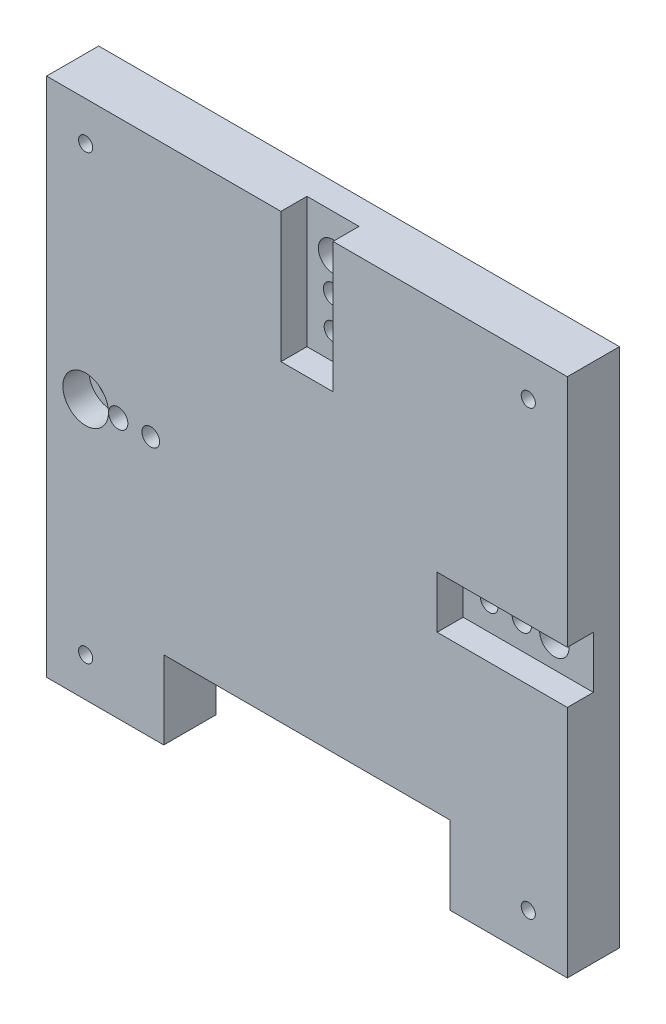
ISO-10303-21;
HEADER;
FILE_DESCRIPTION(('STEP AP214'),'2;1');
FILE_NAME('part.step','',(''),(''),'','','');
FILE_SCHEMA(('AUTOMOTIVE_DESIGN { 1 0 10303 214 1 1 1 1 }'));
ENDSEC;
DATA;
#1=APPLICATION_CONTEXT('core data for automotive mechanical design processes');
#2=APPLICATION_PROTOCOL_DEFINITION('international standard','automotive_design',2000,#1);
#3=PRODUCT_CONTEXT('',#1,'mechanical');
#4=PRODUCT('Part','Part','',(#3));
#5=PRODUCT_RELATED_PRODUCT_CATEGORY('part','',(#4));
#6=PRODUCT_DEFINITION_FORMATION('','',#4);
#7=PRODUCT_DEFINITION_CONTEXT('part definition',#1,'design');
#8=PRODUCT_DEFINITION('design','',#6,#7);
#9=PRODUCT_DEFINITION_SHAPE('','',#8);
#10=(LENGTH_UNIT() NAMED_UNIT(*) SI_UNIT(.MILLI.,.METRE.));
#11=(NAMED_UNIT(*) PLANE_ANGLE_UNIT() SI_UNIT($,.RADIAN.));
#12=(NAMED_UNIT(*) SI_UNIT($,.STERADIAN.) SOLID_ANGLE_UNIT());
#13=UNCERTAINTY_MEASURE_WITH_UNIT(LENGTH_MEASURE(1.E-05),#10,'distance_accuracy_value','');
#14=(GEOMETRIC_REPRESENTATION_CONTEXT(3) GLOBAL_UNCERTAINTY_ASSIGNED_CONTEXT((#13)) GLOBAL_UNIT_ASSIGNED_CONTEXT((#10,
#11,#12)) REPRESENTATION_CONTEXT('',''));
#15=CARTESIAN_POINT('',(0.,0.,0.));
#16=DIRECTION('',(0.,0.,1.));
#17=DIRECTION('',(1.,0.,0.));
#18=AXIS2_PLACEMENT_3D('',#15,#16,#17);
#19=CARTESIAN_POINT('',(-51.7024462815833,-101.028538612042,12.7));
#20=DIRECTION('',(0.,1.,0.));
#21=DIRECTION('',(0.,0.,1.));
#22=AXIS2_PLACEMENT_3D('',#19,#20,#21);
#23=PLANE('',#22);
#24=DIRECTION('',(1.,0.,0.));
#25=VECTOR('',#24,1.);
#26=CARTESIAN_POINT('',(-51.7024462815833,-101.028538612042,0.));
#27=LINE('',#26,#25);
#28=CARTESIAN_POINT('',(-51.7024462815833,-101.028538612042,0.));
#29=VERTEX_POINT('',#28);
#30=CARTESIAN_POINT('',(-23.1274462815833,-101.028538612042,0.));
#31=VERTEX_POINT('',#30);
#32=EDGE_CURVE('E171',#29,#31,#27,.T.);
#33=ORIENTED_EDGE('',*,*,#32,.T.);
#34=DIRECTION('',(0.,0.,1.));
#35=VECTOR('',#34,1.);
#36=CARTESIAN_POINT('',(-23.1274462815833,-101.028538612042,0.));
#37=LINE('',#36,#35);
#38=CARTESIAN_POINT('',(-23.1274462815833,-101.028538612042,12.7));
#39=VERTEX_POINT('',#38);
#40=EDGE_CURVE('E157',#31,#39,#37,.T.);
#41=ORIENTED_EDGE('',*,*,#40,.T.);
#42=DIRECTION('',(1.,0.,0.));
#43=VECTOR('',#42,1.);
#44=CARTESIAN_POINT('',(-51.7024462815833,-101.028538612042,12.7));
#45=LINE('',#44,#43);
#46=CARTESIAN_POINT('',(-51.7024462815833,-101.028538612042,12.7));
#47=VERTEX_POINT('',#46);
#48=EDGE_CURVE('E283',#47,#39,#45,.T.);
#49=ORIENTED_EDGE('',*,*,#48,.F.);
#50=DIRECTION('',(0.,0.,-1.));
#51=VECTOR('',#50,1.);
#52=CARTESIAN_POINT('',(-51.7024462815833,-101.028538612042,12.7));
#53=LINE('',#52,#51);
#54=EDGE_CURVE('E11',#47,#29,#53,.T.);
#55=ORIENTED_EDGE('',*,*,#54,.T.);
#56=EDGE_LOOP('',(#33,#41,#49,#55));
#57=FACE_BOUND('',#56,.T.);
#58=ADVANCED_FACE('F41',(#57),#23,.F.);
#59=CARTESIAN_POINT('',(75.2975537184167,25.9714613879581,12.7));
#60=DIRECTION('',(-1.,0.,0.));
#61=DIRECTION('',(0.,0.,1.));
#62=AXIS2_PLACEMENT_3D('',#59,#60,#61);
#63=PLANE('',#62);
#64=DIRECTION('',(0.,0.,1.));
#65=VECTOR('',#64,1.);
#66=CARTESIAN_POINT('',(75.2975537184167,-43.8785386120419,6.35));
#67=LINE('',#66,#65);
#68=CARTESIAN_POINT('',(75.2975537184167,-43.8785386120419,6.35));
#69=VERTEX_POINT('',#68);
#70=CARTESIAN_POINT('',(75.2975537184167,-43.8785386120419,12.7));
#71=VERTEX_POINT('',#70);
#72=EDGE_CURVE('E352',#69,#71,#67,.T.);
#73=ORIENTED_EDGE('',*,*,#72,.T.);
#74=DIRECTION('',(0.,1.,0.));
#75=VECTOR('',#74,1.);
#76=CARTESIAN_POINT('',(75.2975537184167,25.9714613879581,12.7));
#77=LINE('',#76,#75);
#78=CARTESIAN_POINT('',(75.2975537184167,-101.028538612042,12.7));
#79=VERTEX_POINT('',#78);
#80=EDGE_CURVE('E286',#79,#71,#77,.T.);
#81=ORIENTED_EDGE('',*,*,#80,.F.);
#82=DIRECTION('',(0.,0.,-1.));
#83=VECTOR('',#82,1.);
#84=CARTESIAN_POINT('',(75.2975537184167,-101.028538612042,12.7));
#85=LINE('',#84,#83);
#86=CARTESIAN_POINT('',(75.2975537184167,-101.028538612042,0.));
#87=VERTEX_POINT('',#86);
#88=EDGE_CURVE('E50',#79,#87,#85,.T.);
#89=ORIENTED_EDGE('',*,*,#88,.T.);
#90=DIRECTION('',(0.,1.,0.));
#91=VECTOR('',#90,1.);
#92=CARTESIAN_POINT('',(75.2975537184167,25.9714613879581,0.));
#93=LINE('',#92,#91);
#94=CARTESIAN_POINT('',(75.2975537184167,25.9714613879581,0.));
#95=VERTEX_POINT('',#94);
#96=EDGE_CURVE('E178',#87,#95,#93,.T.);
#97=ORIENTED_EDGE('',*,*,#96,.T.);
#98=DIRECTION('',(0.,0.,-1.));
#99=VECTOR('',#98,1.);
#100=CARTESIAN_POINT('',(75.2975537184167,25.9714613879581,12.7));
#101=LINE('',#100,#99);
#102=CARTESIAN_POINT('',(75.2975537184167,25.9714613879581,12.7));
#103=VERTEX_POINT('',#102);
#104=EDGE_CURVE('E192',#103,#95,#101,.T.);
#105=ORIENTED_EDGE('',*,*,#104,.F.);
#106=CARTESIAN_POINT('',(75.2975537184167,-31.1785386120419,12.7));
#107=VERTEX_POINT('',#106);
#108=EDGE_CURVE('E285',#107,#103,#77,.T.);
#109=ORIENTED_EDGE('',*,*,#108,.F.);
#110=DIRECTION('',(0.,0.,1.));
#111=VECTOR('',#110,1.);
#112=CARTESIAN_POINT('',(75.2975537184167,-31.1785386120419,6.35));
#113=LINE('',#112,#111);
#114=CARTESIAN_POINT('',(75.2975537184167,-31.1785386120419,6.35));
#115=VERTEX_POINT('',#114);
#116=EDGE_CURVE('E350',#115,#107,#113,.T.);
#117=ORIENTED_EDGE('',*,*,#116,.F.);
#118=DIRECTION('',(0.,-1.,0.));
#119=VECTOR('',#118,1.);
#120=CARTESIAN_POINT('',(75.2975537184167,-31.1785386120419,6.35));
#121=LINE('',#120,#119);
#122=EDGE_CURVE('E354',#115,#69,#121,.T.);
#123=ORIENTED_EDGE('',*,*,#122,.T.);
#124=EDGE_LOOP('',(#73,#81,#89,#97,#105,#109,#117,#123));
#125=FACE_BOUND('',#124,.T.);
#126=ADVANCED_FACE('F311',(#125),#63,.F.);
#127=CARTESIAN_POINT('',(0.,0.,12.7));
#128=DIRECTION('',(0.,0.,1.));
#129=DIRECTION('',(1.,0.,0.));
#130=AXIS2_PLACEMENT_3D('',#127,#128,#129);
#131=PLANE('',#130);
#132=DIRECTION('',(0.,-1.,0.));
#133=VECTOR('',#132,1.);
#134=CARTESIAN_POINT('',(-23.1274462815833,-101.028538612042,12.7));
#135=LINE('',#134,#133);
#136=CARTESIAN_POINT('',(-23.1274462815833,-81.9785386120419,12.7));
#137=VERTEX_POINT('',#136);
#138=EDGE_CURVE('E162',#137,#39,#135,.T.);
#139=ORIENTED_EDGE('',*,*,#138,.F.);
#140=DIRECTION('',(-1.,0.,0.));
#141=VECTOR('',#140,1.);
#142=CARTESIAN_POINT('',(-23.1274462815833,-81.9785386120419,12.7));
#143=LINE('',#142,#141);
#144=CARTESIAN_POINT('',(46.7225537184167,-81.9785386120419,12.7));
#145=VERTEX_POINT('',#144);
#146=EDGE_CURVE('E174',#145,#137,#143,.T.);
#147=ORIENTED_EDGE('',*,*,#146,.F.);
#148=DIRECTION('',(0.,1.,0.));
#149=VECTOR('',#148,1.);
#150=CARTESIAN_POINT('',(46.7225537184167,-101.028538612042,12.7));
#151=LINE('',#150,#149);
#152=CARTESIAN_POINT('',(46.7225537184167,-101.028538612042,12.7));
#153=VERTEX_POINT('',#152);
#154=EDGE_CURVE('E415',#153,#145,#151,.T.);
#155=ORIENTED_EDGE('',*,*,#154,.F.);
#156=EDGE_CURVE('E282',#153,#79,#45,.T.);
#157=ORIENTED_EDGE('',*,*,#156,.T.);
#158=ORIENTED_EDGE('',*,*,#80,.T.);
#159=DIRECTION('',(-1.,0.,0.));
#160=VECTOR('',#159,1.);
#161=CARTESIAN_POINT('',(75.2975537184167,-43.8785386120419,12.7));
#162=LINE('',#161,#160);
#163=CARTESIAN_POINT('',(43.5475537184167,-43.8785386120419,12.7));
#164=VERTEX_POINT('',#163);
#165=EDGE_CURVE('E331',#71,#164,#162,.T.);
#166=ORIENTED_EDGE('',*,*,#165,.T.);
#167=DIRECTION('',(0.,-1.,0.));
#168=VECTOR('',#167,1.);
#169=CARTESIAN_POINT('',(43.5475537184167,-31.1785386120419,12.7));
#170=LINE('',#169,#168);
#171=CARTESIAN_POINT('',(43.5475537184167,-31.1785386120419,12.7));
#172=VERTEX_POINT('',#171);
#173=EDGE_CURVE('E358',#172,#164,#170,.T.);
#174=ORIENTED_EDGE('',*,*,#173,.F.);
#175=DIRECTION('',(-1.,0.,0.));
#176=VECTOR('',#175,1.);
#177=CARTESIAN_POINT('',(75.2975537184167,-31.1785386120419,12.7));
#178=LINE('',#177,#176);
#179=EDGE_CURVE('E355',#107,#172,#178,.T.);
#180=ORIENTED_EDGE('',*,*,#179,.F.);
#181=ORIENTED_EDGE('',*,*,#108,.T.);
#182=DIRECTION('',(-1.,0.,0.));
#183=VECTOR('',#182,1.);
#184=CARTESIAN_POINT('',(-51.7024462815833,25.9714613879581,12.7));
#185=LINE('',#184,#183);
#186=CARTESIAN_POINT('',(18.1475537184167,25.9714613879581,12.7));
#187=VERTEX_POINT('',#186);
#188=EDGE_CURVE('E193',#103,#187,#185,.T.);
#189=ORIENTED_EDGE('',*,*,#188,.T.);
#190=DIRECTION('',(0.,-1.,0.));
#191=VECTOR('',#190,1.);
#192=CARTESIAN_POINT('',(18.1475537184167,25.9714613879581,12.7));
#193=LINE('',#192,#191);
#194=CARTESIAN_POINT('',(18.1475537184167,-5.77853861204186,12.7));
#195=VERTEX_POINT('',#194);
#196=EDGE_CURVE('E333',#187,#195,#193,.T.);
#197=ORIENTED_EDGE('',*,*,#196,.T.);
#198=DIRECTION('',(1.,0.,0.));
#199=VECTOR('',#198,1.);
#200=CARTESIAN_POINT('',(5.44755371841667,-5.77853861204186,12.7));
#201=LINE('',#200,#199);
#202=CARTESIAN_POINT('',(5.44755371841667,-5.77853861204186,12.7));
#203=VERTEX_POINT('',#202);
#204=EDGE_CURVE('E66',#203,#195,#201,.T.);
#205=ORIENTED_EDGE('',*,*,#204,.F.);
#206=DIRECTION('',(0.,-1.,0.));
#207=VECTOR('',#206,1.);
#208=CARTESIAN_POINT('',(5.44755371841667,25.9714613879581,12.7));
#209=LINE('',#208,#207);
#210=CARTESIAN_POINT('',(5.44755371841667,25.9714613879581,12.7));
#211=VERTEX_POINT('',#210);
#212=EDGE_CURVE('E300',#211,#203,#209,.T.);
#213=ORIENTED_EDGE('',*,*,#212,.F.);
#214=CARTESIAN_POINT('',(-51.7024462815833,25.9714613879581,12.7));
#215=VERTEX_POINT('',#214);
#216=EDGE_CURVE('E288',#211,#215,#185,.T.);
#217=ORIENTED_EDGE('',*,*,#216,.T.);
#218=DIRECTION('',(0.,-1.,0.));
#219=VECTOR('',#218,1.);
#220=CARTESIAN_POINT('',(-51.7024462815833,25.9714613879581,12.7));
#221=LINE('',#220,#219);
#222=EDGE_CURVE('E188',#215,#47,#221,.T.);
#223=ORIENTED_EDGE('',*,*,#222,.T.);
#224=ORIENTED_EDGE('',*,*,#48,.T.);
#225=EDGE_LOOP('',(#139,#147,#155,#157,#158,#166,#174,#180,#181,#189,#197,#205,#213,#217,#223,#224));
#226=FACE_BOUND('',#225,.T.);
#227=CARTESIAN_POINT('',(-42.1774462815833,-37.5285386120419,12.7));
#228=DIRECTION('',(0.,0.,1.));
#229=DIRECTION('',(1.,0.,0.));
#230=AXIS2_PLACEMENT_3D('',#227,#228,#229);
#231=CIRCLE('',#230,5.55625);
#232=CARTESIAN_POINT('',(-36.6211962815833,-37.5285386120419,12.7));
#233=VERTEX_POINT('',#232);
#234=EDGE_CURVE('E337',#233,#233,#231,.T.);
#235=ORIENTED_EDGE('',*,*,#234,.F.);
#236=EDGE_LOOP('',(#235));
#237=FACE_BOUND('',#236,.T.);
#238=CARTESIAN_POINT('',(-26.3024462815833,-37.5285386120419,12.7));
#239=DIRECTION('',(0.,0.,1.));
#240=DIRECTION('',(1.,0.,0.));
#241=AXIS2_PLACEMENT_3D('',#238,#239,#240);
#242=CIRCLE('',#241,2.15265);
#243=CARTESIAN_POINT('',(-24.1497962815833,-37.5285386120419,12.7));
#244=VERTEX_POINT('',#243);
#245=EDGE_CURVE('E268',#244,#244,#242,.T.);
#246=ORIENTED_EDGE('',*,*,#245,.F.);
#247=EDGE_LOOP('',(#246));
#248=FACE_BOUND('',#247,.T.);
#249=CARTESIAN_POINT('',(-34.2399462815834,-37.5285386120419,12.7));
#250=DIRECTION('',(0.,0.,1.));
#251=DIRECTION('',(1.,0.,0.));
#252=AXIS2_PLACEMENT_3D('',#249,#250,#251);
#253=CIRCLE('',#252,2.3495);
#254=CARTESIAN_POINT('',(-31.8904462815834,-37.5285386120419,12.7));
#255=VERTEX_POINT('',#254);
#256=EDGE_CURVE('E256',#255,#255,#253,.T.);
#257=ORIENTED_EDGE('',*,*,#256,.F.);
#258=EDGE_LOOP('',(#257));
#259=FACE_BOUND('',#258,.T.);
#260=CARTESIAN_POINT('',(-42.1774462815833,-91.5035386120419,12.7));
#261=DIRECTION('',(0.,0.,1.));
#262=DIRECTION('',(1.,0.,0.));
#263=AXIS2_PLACEMENT_3D('',#260,#261,#262);
#264=CIRCLE('',#263,1.7272);
#265=CARTESIAN_POINT('',(-40.4502462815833,-91.5035386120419,12.7));
#266=VERTEX_POINT('',#265);
#267=EDGE_CURVE('E241',#266,#266,#264,.T.);
#268=ORIENTED_EDGE('',*,*,#267,.F.);
#269=EDGE_LOOP('',(#268));
#270=FACE_BOUND('',#269,.T.);
#271=CARTESIAN_POINT('',(65.7725537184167,-91.5035386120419,12.7));
#272=DIRECTION('',(0.,0.,1.));
#273=DIRECTION('',(1.,0.,0.));
#274=AXIS2_PLACEMENT_3D('',#271,#272,#273);
#275=CIRCLE('',#274,1.7272);
#276=CARTESIAN_POINT('',(67.4997537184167,-91.5035386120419,12.7));
#277=VERTEX_POINT('',#276);
#278=EDGE_CURVE('E235',#277,#277,#275,.T.);
#279=ORIENTED_EDGE('',*,*,#278,.F.);
#280=EDGE_LOOP('',(#279));
#281=FACE_BOUND('',#280,.T.);
#282=CARTESIAN_POINT('',(65.7725537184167,16.4464613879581,12.7));
#283=DIRECTION('',(0.,0.,1.));
#284=DIRECTION('',(1.,0.,0.));
#285=AXIS2_PLACEMENT_3D('',#282,#283,#284);
#286=CIRCLE('',#285,1.7272);
#287=CARTESIAN_POINT('',(67.4997537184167,16.4464613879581,12.7));
#288=VERTEX_POINT('',#287);
#289=EDGE_CURVE('E229',#288,#288,#286,.T.);
#290=ORIENTED_EDGE('',*,*,#289,.F.);
#291=EDGE_LOOP('',(#290));
#292=FACE_BOUND('',#291,.T.);
#293=CARTESIAN_POINT('',(-42.1774462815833,16.4464613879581,12.7));
#294=DIRECTION('',(0.,0.,1.));
#295=DIRECTION('',(1.,0.,0.));
#296=AXIS2_PLACEMENT_3D('',#293,#294,#295);
#297=CIRCLE('',#296,1.7272);
#298=CARTESIAN_POINT('',(-40.4502462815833,16.4464613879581,12.7));
#299=VERTEX_POINT('',#298);
#300=EDGE_CURVE('E223',#299,#299,#297,.T.);
#301=ORIENTED_EDGE('',*,*,#300,.F.);
#302=EDGE_LOOP('',(#301));
#303=FACE_BOUND('',#302,.T.);
#304=ADVANCED_FACE('F296',(#226,#237,#248,#259,#270,#281,#292,#303),#131,.T.);
#305=CARTESIAN_POINT('',(49.8975537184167,-37.5285386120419,12.7));
#306=DIRECTION('',(0.,0.,1.));
#307=DIRECTION('',(1.,0.,0.));
#308=AXIS2_PLACEMENT_3D('',#305,#306,#307);
#309=CYLINDRICAL_SURFACE('',#308,2.15265);
#310=CARTESIAN_POINT('',(49.8975537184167,-37.5285386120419,0.));
#311=DIRECTION('',(0.,0.,1.));
#312=DIRECTION('',(1.,0.,0.));
#313=AXIS2_PLACEMENT_3D('',#310,#311,#312);
#314=CIRCLE('',#313,2.15265);
#315=CARTESIAN_POINT('',(52.0502037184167,-37.5285386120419,0.));
#316=VERTEX_POINT('',#315);
#317=EDGE_CURVE('E274',#316,#316,#314,.T.);
#318=ORIENTED_EDGE('',*,*,#317,.F.);
#319=EDGE_LOOP('',(#318));
#320=FACE_BOUND('',#319,.T.);
#321=CARTESIAN_POINT('',(49.8975537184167,-37.5285386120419,6.35));
#322=DIRECTION('',(0.,0.,1.));
#323=DIRECTION('',(1.,0.,0.));
#324=AXIS2_PLACEMENT_3D('',#321,#322,#323);
#325=CIRCLE('',#324,2.15265);
#326=CARTESIAN_POINT('',(52.0502037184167,-37.5285386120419,6.35));
#327=VERTEX_POINT('',#326);
#328=EDGE_CURVE('E207',#327,#327,#325,.F.);
#329=ORIENTED_EDGE('',*,*,#328,.F.);
#330=EDGE_LOOP('',(#329));
#331=FACE_BOUND('',#330,.T.);
#332=ADVANCED_FACE('F434',(#320,#331),#309,.F.);
#333=CARTESIAN_POINT('',(57.8350537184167,-37.5285386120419,12.7));
#334=DIRECTION('',(0.,0.,1.));
#335=DIRECTION('',(1.,0.,0.));
#336=AXIS2_PLACEMENT_3D('',#333,#334,#335);
#337=CYLINDRICAL_SURFACE('',#336,2.3495);
#338=CARTESIAN_POINT('',(57.8350537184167,-37.5285386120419,0.));
#339=DIRECTION('',(0.,0.,1.));
#340=DIRECTION('',(1.,0.,0.));
#341=AXIS2_PLACEMENT_3D('',#338,#339,#340);
#342=CIRCLE('',#341,2.3495);
#343=CARTESIAN_POINT('',(60.1845537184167,-37.5285386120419,0.));
#344=VERTEX_POINT('',#343);
#345=EDGE_CURVE('E262',#344,#344,#342,.T.);
#346=ORIENTED_EDGE('',*,*,#345,.F.);
#347=EDGE_LOOP('',(#346));
#348=FACE_BOUND('',#347,.T.);
#349=CARTESIAN_POINT('',(57.8350537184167,-37.5285386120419,6.35));
#350=DIRECTION('',(0.,0.,1.));
#351=DIRECTION('',(1.,0.,0.));
#352=AXIS2_PLACEMENT_3D('',#349,#350,#351);
#353=CIRCLE('',#352,2.3495);
#354=CARTESIAN_POINT('',(60.1845537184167,-37.5285386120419,6.35));
#355=VERTEX_POINT('',#354);
#356=EDGE_CURVE('E203',#355,#355,#353,.F.);
#357=ORIENTED_EDGE('',*,*,#356,.F.);
#358=EDGE_LOOP('',(#357));
#359=FACE_BOUND('',#358,.T.);
#360=ADVANCED_FACE('F479',(#348,#359),#337,.F.);
#361=CARTESIAN_POINT('',(65.7725537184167,-37.5285386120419,12.7));
#362=DIRECTION('',(0.,0.,1.));
#363=DIRECTION('',(1.,0.,0.));
#364=AXIS2_PLACEMENT_3D('',#361,#362,#363);
#365=CYLINDRICAL_SURFACE('',#364,3.571875);
#366=CARTESIAN_POINT('',(65.7725537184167,-37.5285386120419,0.));
#367=DIRECTION('',(0.,0.,1.));
#368=DIRECTION('',(1.,0.,0.));
#369=AXIS2_PLACEMENT_3D('',#366,#367,#368);
#370=CIRCLE('',#369,3.571875);
#371=CARTESIAN_POINT('',(69.3444287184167,-37.5285386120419,0.));
#372=VERTEX_POINT('',#371);
#373=EDGE_CURVE('E250',#372,#372,#370,.T.);
#374=ORIENTED_EDGE('',*,*,#373,.F.);
#375=EDGE_LOOP('',(#374));
#376=FACE_BOUND('',#375,.T.);
#377=CARTESIAN_POINT('',(65.7725537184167,-37.5285386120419,6.35));
#378=DIRECTION('',(0.,0.,1.));
#379=DIRECTION('',(1.,0.,0.));
#380=AXIS2_PLACEMENT_3D('',#377,#378,#379);
#381=CIRCLE('',#380,3.571875);
#382=CARTESIAN_POINT('',(69.3444287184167,-37.5285386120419,6.35));
#383=VERTEX_POINT('',#382);
#384=EDGE_CURVE('E200',#383,#383,#381,.F.);
#385=ORIENTED_EDGE('',*,*,#384,.F.);
#386=EDGE_LOOP('',(#385));
#387=FACE_BOUND('',#386,.T.);
#388=ADVANCED_FACE('F475',(#376,#387),#365,.F.);
#389=CARTESIAN_POINT('',(-42.1774462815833,-37.5285386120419,12.7));
#390=DIRECTION('',(0.,0.,1.));
#391=DIRECTION('',(1.,0.,0.));
#392=AXIS2_PLACEMENT_3D('',#389,#390,#391);
#393=CYLINDRICAL_SURFACE('',#392,3.571875);
#394=CARTESIAN_POINT('',(-42.1774462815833,-37.5285386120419,0.));
#395=DIRECTION('',(0.,0.,1.));
#396=DIRECTION('',(1.,0.,0.));
#397=AXIS2_PLACEMENT_3D('',#394,#395,#396);
#398=CIRCLE('',#397,3.571875);
#399=CARTESIAN_POINT('',(-38.6055712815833,-37.5285386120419,0.));
#400=VERTEX_POINT('',#399);
#401=EDGE_CURVE('E247',#400,#400,#398,.T.);
#402=ORIENTED_EDGE('',*,*,#401,.F.);
#403=EDGE_LOOP('',(#402));
#404=FACE_BOUND('',#403,.T.);
#405=CARTESIAN_POINT('',(-42.1774462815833,-37.5285386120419,6.35));
#406=DIRECTION('',(0.,0.,1.));
#407=DIRECTION('',(1.,0.,0.));
#408=AXIS2_PLACEMENT_3D('',#405,#406,#407);
#409=CIRCLE('',#408,3.571875);
#410=CARTESIAN_POINT('',(-38.6055712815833,-37.5285386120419,6.35));
#411=VERTEX_POINT('',#410);
#412=EDGE_CURVE('E198',#411,#411,#409,.F.);
#413=ORIENTED_EDGE('',*,*,#412,.F.);
#414=EDGE_LOOP('',(#413));
#415=FACE_BOUND('',#414,.T.);
#416=ADVANCED_FACE('F409',(#404,#415),#393,.F.);
#417=CARTESIAN_POINT('',(-51.7024462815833,25.9714613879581,12.7));
#418=DIRECTION('',(1.,0.,0.));
#419=DIRECTION('',(0.,0.,-1.));
#420=AXIS2_PLACEMENT_3D('',#417,#418,#419);
#421=PLANE('',#420);
#422=DIRECTION('',(0.,-1.,0.));
#423=VECTOR('',#422,1.);
#424=CARTESIAN_POINT('',(-51.7024462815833,25.9714613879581,0.));
#425=LINE('',#424,#423);
#426=CARTESIAN_POINT('',(-51.7024462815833,25.9714613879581,0.));
#427=VERTEX_POINT('',#426);
#428=EDGE_CURVE('E183',#427,#29,#425,.T.);
#429=ORIENTED_EDGE('',*,*,#428,.T.);
#430=ORIENTED_EDGE('',*,*,#54,.F.);
#431=ORIENTED_EDGE('',*,*,#222,.F.);
#432=DIRECTION('',(0.,0.,-1.));
#433=VECTOR('',#432,1.);
#434=CARTESIAN_POINT('',(-51.7024462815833,25.9714613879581,12.7));
#435=LINE('',#434,#433);
#436=EDGE_CURVE('E189',#215,#427,#435,.T.);
#437=ORIENTED_EDGE('',*,*,#436,.T.);
#438=EDGE_LOOP('',(#429,#430,#431,#437));
#439=FACE_BOUND('',#438,.T.);
#440=ADVANCED_FACE('F43',(#439),#421,.F.);
#441=ORIENTED_EDGE('',*,*,#156,.F.);
#442=DIRECTION('',(0.,0.,1.));
#443=VECTOR('',#442,1.);
#444=CARTESIAN_POINT('',(46.7225537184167,-101.028538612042,0.));
#445=LINE('',#444,#443);
#446=CARTESIAN_POINT('',(46.7225537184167,-101.028538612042,0.));
#447=VERTEX_POINT('',#446);
#448=EDGE_CURVE('E166',#447,#153,#445,.T.);
#449=ORIENTED_EDGE('',*,*,#448,.F.);
#450=EDGE_CURVE('E179',#447,#87,#27,.T.);
#451=ORIENTED_EDGE('',*,*,#450,.T.);
#452=ORIENTED_EDGE('',*,*,#88,.F.);
#453=EDGE_LOOP('',(#441,#449,#451,#452));
#454=FACE_BOUND('',#453,.T.);
#455=ADVANCED_FACE('F397',(#454),#23,.F.);
#456=CARTESIAN_POINT('',(-51.7024462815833,25.9714613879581,12.7));
#457=DIRECTION('',(0.,-1.,0.));
#458=DIRECTION('',(0.,0.,-1.));
#459=AXIS2_PLACEMENT_3D('',#456,#457,#458);
#460=PLANE('',#459);
#461=ORIENTED_EDGE('',*,*,#216,.F.);
#462=DIRECTION('',(0.,0.,1.));
#463=VECTOR('',#462,1.);
#464=CARTESIAN_POINT('',(5.44755371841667,25.9714613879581,6.35));
#465=LINE('',#464,#463);
#466=CARTESIAN_POINT('',(5.44755371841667,25.9714613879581,6.35));
#467=VERTEX_POINT('',#466);
#468=EDGE_CURVE('E322',#467,#211,#465,.T.);
#469=ORIENTED_EDGE('',*,*,#468,.F.);
#470=DIRECTION('',(1.,0.,0.));
#471=VECTOR('',#470,1.);
#472=CARTESIAN_POINT('',(5.44755371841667,25.9714613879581,6.35));
#473=LINE('',#472,#471);
#474=CARTESIAN_POINT('',(18.1475537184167,25.9714613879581,6.35));
#475=VERTEX_POINT('',#474);
#476=EDGE_CURVE('E318',#467,#475,#473,.T.);
#477=ORIENTED_EDGE('',*,*,#476,.T.);
#478=DIRECTION('',(0.,0.,1.));
#479=VECTOR('',#478,1.);
#480=CARTESIAN_POINT('',(18.1475537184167,25.9714613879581,6.35));
#481=LINE('',#480,#479);
#482=EDGE_CURVE('E317',#475,#187,#481,.T.);
#483=ORIENTED_EDGE('',*,*,#482,.T.);
#484=ORIENTED_EDGE('',*,*,#188,.F.);
#485=ORIENTED_EDGE('',*,*,#104,.T.);
#486=DIRECTION('',(-1.,0.,0.));
#487=VECTOR('',#486,1.);
#488=CARTESIAN_POINT('',(-51.7024462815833,25.9714613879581,0.));
#489=LINE('',#488,#487);
#490=EDGE_CURVE('E181',#95,#427,#489,.T.);
#491=ORIENTED_EDGE('',*,*,#490,.T.);
#492=ORIENTED_EDGE('',*,*,#436,.F.);
#493=EDGE_LOOP('',(#461,#469,#477,#483,#484,#485,#491,#492));
#494=FACE_BOUND('',#493,.T.);
#495=ADVANCED_FACE('F303',(#494),#460,.F.);
#496=CARTESIAN_POINT('',(0.,0.,0.));
#497=DIRECTION('',(0.,0.,1.));
#498=DIRECTION('',(1.,0.,0.));
#499=AXIS2_PLACEMENT_3D('',#496,#497,#498);
#500=PLANE('',#499);
#501=CARTESIAN_POINT('',(-42.1774462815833,16.4464613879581,0.));
#502=DIRECTION('',(0.,0.,1.));
#503=DIRECTION('',(1.,0.,0.));
#504=AXIS2_PLACEMENT_3D('',#501,#502,#503);
#505=CIRCLE('',#504,1.7272);
#506=CARTESIAN_POINT('',(-40.4502462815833,16.4464613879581,0.));
#507=VERTEX_POINT('',#506);
#508=EDGE_CURVE('E226',#507,#507,#505,.T.);
#509=ORIENTED_EDGE('',*,*,#508,.T.);
#510=EDGE_LOOP('',(#509));
#511=FACE_BOUND('',#510,.T.);
#512=CARTESIAN_POINT('',(65.7725537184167,16.4464613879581,0.));
#513=DIRECTION('',(0.,0.,1.));
#514=DIRECTION('',(1.,0.,0.));
#515=AXIS2_PLACEMENT_3D('',#512,#513,#514);
#516=CIRCLE('',#515,1.7272);
#517=CARTESIAN_POINT('',(67.4997537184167,16.4464613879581,0.));
#518=VERTEX_POINT('',#517);
#519=EDGE_CURVE('E232',#518,#518,#516,.T.);
#520=ORIENTED_EDGE('',*,*,#519,.T.);
#521=EDGE_LOOP('',(#520));
#522=FACE_BOUND('',#521,.T.);
#523=CARTESIAN_POINT('',(65.7725537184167,-91.5035386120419,0.));
#524=DIRECTION('',(0.,0.,1.));
#525=DIRECTION('',(1.,0.,0.));
#526=AXIS2_PLACEMENT_3D('',#523,#524,#525);
#527=CIRCLE('',#526,1.7272);
#528=CARTESIAN_POINT('',(67.4997537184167,-91.5035386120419,0.));
#529=VERTEX_POINT('',#528);
#530=EDGE_CURVE('E238',#529,#529,#527,.T.);
#531=ORIENTED_EDGE('',*,*,#530,.T.);
#532=EDGE_LOOP('',(#531));
#533=FACE_BOUND('',#532,.T.);
#534=CARTESIAN_POINT('',(-42.1774462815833,-91.5035386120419,0.));
#535=DIRECTION('',(0.,0.,1.));
#536=DIRECTION('',(1.,0.,0.));
#537=AXIS2_PLACEMENT_3D('',#534,#535,#536);
#538=CIRCLE('',#537,1.7272);
#539=CARTESIAN_POINT('',(-40.4502462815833,-91.5035386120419,0.));
#540=VERTEX_POINT('',#539);
#541=EDGE_CURVE('E244',#540,#540,#538,.T.);
#542=ORIENTED_EDGE('',*,*,#541,.T.);
#543=EDGE_LOOP('',(#542));
#544=FACE_BOUND('',#543,.T.);
#545=ORIENTED_EDGE('',*,*,#401,.T.);
#546=EDGE_LOOP('',(#545));
#547=FACE_BOUND('',#546,.T.);
#548=ORIENTED_EDGE('',*,*,#373,.T.);
#549=EDGE_LOOP('',(#548));
#550=FACE_BOUND('',#549,.T.);
#551=CARTESIAN_POINT('',(11.7975537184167,16.4464613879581,0.));
#552=DIRECTION('',(0.,0.,1.));
#553=DIRECTION('',(1.,0.,0.));
#554=AXIS2_PLACEMENT_3D('',#551,#552,#553);
#555=CIRCLE('',#554,3.571875);
#556=CARTESIAN_POINT('',(15.3694287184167,16.4464613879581,0.));
#557=VERTEX_POINT('',#556);
#558=EDGE_CURVE('E253',#557,#557,#555,.T.);
#559=ORIENTED_EDGE('',*,*,#558,.T.);
#560=EDGE_LOOP('',(#559));
#561=FACE_BOUND('',#560,.T.);
#562=CARTESIAN_POINT('',(-34.2399462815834,-37.5285386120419,0.));
#563=DIRECTION('',(0.,0.,1.));
#564=DIRECTION('',(1.,0.,0.));
#565=AXIS2_PLACEMENT_3D('',#562,#563,#564);
#566=CIRCLE('',#565,2.3495);
#567=CARTESIAN_POINT('',(-31.8904462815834,-37.5285386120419,0.));
#568=VERTEX_POINT('',#567);
#569=EDGE_CURVE('E259',#568,#568,#566,.T.);
#570=ORIENTED_EDGE('',*,*,#569,.T.);
#571=EDGE_LOOP('',(#570));
#572=FACE_BOUND('',#571,.T.);
#573=ORIENTED_EDGE('',*,*,#345,.T.);
#574=EDGE_LOOP('',(#573));
#575=FACE_BOUND('',#574,.T.);
#576=CARTESIAN_POINT('',(11.7975537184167,8.50896138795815,0.));
#577=DIRECTION('',(0.,0.,1.));
#578=DIRECTION('',(1.,0.,0.));
#579=AXIS2_PLACEMENT_3D('',#576,#577,#578);
#580=CIRCLE('',#579,2.3495);
#581=CARTESIAN_POINT('',(14.1470537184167,8.50896138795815,0.));
#582=VERTEX_POINT('',#581);
#583=EDGE_CURVE('E265',#582,#582,#580,.T.);
#584=ORIENTED_EDGE('',*,*,#583,.T.);
#585=EDGE_LOOP('',(#584));
#586=FACE_BOUND('',#585,.T.);
#587=CARTESIAN_POINT('',(-26.3024462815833,-37.5285386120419,0.));
#588=DIRECTION('',(0.,0.,1.));
#589=DIRECTION('',(1.,0.,0.));
#590=AXIS2_PLACEMENT_3D('',#587,#588,#589);
#591=CIRCLE('',#590,2.15265);
#592=CARTESIAN_POINT('',(-24.1497962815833,-37.5285386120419,0.));
#593=VERTEX_POINT('',#592);
#594=EDGE_CURVE('E271',#593,#593,#591,.T.);
#595=ORIENTED_EDGE('',*,*,#594,.T.);
#596=EDGE_LOOP('',(#595));
#597=FACE_BOUND('',#596,.T.);
#598=ORIENTED_EDGE('',*,*,#317,.T.);
#599=EDGE_LOOP('',(#598));
#600=FACE_BOUND('',#599,.T.);
#601=CARTESIAN_POINT('',(11.7975537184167,0.571461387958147,0.));
#602=DIRECTION('',(0.,0.,1.));
#603=DIRECTION('',(1.,0.,0.));
#604=AXIS2_PLACEMENT_3D('',#601,#602,#603);
#605=CIRCLE('',#604,2.15265);
#606=CARTESIAN_POINT('',(13.9502037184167,0.571461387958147,0.));
#607=VERTEX_POINT('',#606);
#608=EDGE_CURVE('E277',#607,#607,#605,.T.);
#609=ORIENTED_EDGE('',*,*,#608,.T.);
#610=EDGE_LOOP('',(#609));
#611=FACE_BOUND('',#610,.T.);
#612=DIRECTION('',(-1.,0.,0.));
#613=VECTOR('',#612,1.);
#614=CARTESIAN_POINT('',(-23.1274462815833,-81.9785386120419,0.));
#615=LINE('',#614,#613);
#616=CARTESIAN_POINT('',(46.7225537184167,-81.9785386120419,0.));
#617=VERTEX_POINT('',#616);
#618=CARTESIAN_POINT('',(-23.1274462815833,-81.9785386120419,0.));
#619=VERTEX_POINT('',#618);
#620=EDGE_CURVE('E58',#617,#619,#615,.T.);
#621=ORIENTED_EDGE('',*,*,#620,.T.);
#622=DIRECTION('',(0.,-1.,0.));
#623=VECTOR('',#622,1.);
#624=CARTESIAN_POINT('',(-23.1274462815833,-101.028538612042,0.));
#625=LINE('',#624,#623);
#626=EDGE_CURVE('E160',#619,#31,#625,.T.);
#627=ORIENTED_EDGE('',*,*,#626,.T.);
#628=ORIENTED_EDGE('',*,*,#32,.F.);
#629=ORIENTED_EDGE('',*,*,#428,.F.);
#630=ORIENTED_EDGE('',*,*,#490,.F.);
#631=ORIENTED_EDGE('',*,*,#96,.F.);
#632=ORIENTED_EDGE('',*,*,#450,.F.);
#633=DIRECTION('',(0.,1.,0.));
#634=VECTOR('',#633,1.);
#635=CARTESIAN_POINT('',(46.7225537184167,-101.028538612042,0.));
#636=LINE('',#635,#634);
#637=EDGE_CURVE('E173',#447,#617,#636,.T.);
#638=ORIENTED_EDGE('',*,*,#637,.T.);
#639=EDGE_LOOP('',(#621,#627,#628,#629,#630,#631,#632,#638));
#640=FACE_BOUND('',#639,.T.);
#641=ADVANCED_FACE('F169',(#511,#522,#533,#544,#547,#550,#561,#572,#575,#586,#597,#600,#611,
#640),#500,.F.);
#642=CARTESIAN_POINT('',(11.7975537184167,0.571461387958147,12.7));
#643=DIRECTION('',(0.,0.,1.));
#644=DIRECTION('',(1.,0.,0.));
#645=AXIS2_PLACEMENT_3D('',#642,#643,#644);
#646=CYLINDRICAL_SURFACE('',#645,2.15265);
#647=CARTESIAN_POINT('',(11.7975537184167,0.571461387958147,6.35));
#648=DIRECTION('',(0.,0.,-1.));
#649=DIRECTION('',(-1.,0.,0.));
#650=AXIS2_PLACEMENT_3D('',#647,#648,#649);
#651=CIRCLE('',#650,2.15265);
#652=CARTESIAN_POINT('',(9.64490371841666,0.571461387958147,6.35));
#653=VERTEX_POINT('',#652);
#654=EDGE_CURVE('E220',#653,#653,#651,.F.);
#655=ORIENTED_EDGE('',*,*,#654,.T.);
#656=EDGE_LOOP('',(#655));
#657=FACE_BOUND('',#656,.T.);
#658=ORIENTED_EDGE('',*,*,#608,.F.);
#659=EDGE_LOOP('',(#658));
#660=FACE_BOUND('',#659,.T.);
#661=ADVANCED_FACE('F498',(#657,#660),#646,.F.);
#662=CARTESIAN_POINT('',(-26.3024462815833,-37.5285386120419,12.7));
#663=DIRECTION('',(0.,0.,1.));
#664=DIRECTION('',(1.,0.,0.));
#665=AXIS2_PLACEMENT_3D('',#662,#663,#664);
#666=CYLINDRICAL_SURFACE('',#665,2.15265);
#667=ORIENTED_EDGE('',*,*,#594,.F.);
#668=EDGE_LOOP('',(#667));
#669=FACE_BOUND('',#668,.T.);
#670=ORIENTED_EDGE('',*,*,#245,.T.);
#671=EDGE_LOOP('',(#670));
#672=FACE_BOUND('',#671,.T.);
#673=ADVANCED_FACE('F494',(#669,#672),#666,.F.);
#674=CARTESIAN_POINT('',(11.7975537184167,8.50896138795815,12.7));
#675=DIRECTION('',(0.,0.,1.));
#676=DIRECTION('',(1.,0.,0.));
#677=AXIS2_PLACEMENT_3D('',#674,#675,#676);
#678=CYLINDRICAL_SURFACE('',#677,2.3495);
#679=CARTESIAN_POINT('',(11.7975537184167,8.50896138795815,6.35));
#680=DIRECTION('',(0.,0.,-1.));
#681=DIRECTION('',(-1.,0.,0.));
#682=AXIS2_PLACEMENT_3D('',#679,#680,#681);
#683=CIRCLE('',#682,2.3495);
#684=CARTESIAN_POINT('',(9.44805371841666,8.50896138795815,6.35));
#685=VERTEX_POINT('',#684);
#686=EDGE_CURVE('E217',#685,#685,#683,.F.);
#687=ORIENTED_EDGE('',*,*,#686,.T.);
#688=EDGE_LOOP('',(#687));
#689=FACE_BOUND('',#688,.T.);
#690=ORIENTED_EDGE('',*,*,#583,.F.);
#691=EDGE_LOOP('',(#690));
#692=FACE_BOUND('',#691,.T.);
#693=ADVANCED_FACE('F487',(#689,#692),#678,.F.);
#694=CARTESIAN_POINT('',(-34.2399462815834,-37.5285386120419,12.7));
#695=DIRECTION('',(0.,0.,1.));
#696=DIRECTION('',(1.,0.,0.));
#697=AXIS2_PLACEMENT_3D('',#694,#695,#696);
#698=CYLINDRICAL_SURFACE('',#697,2.3495);
#699=ORIENTED_EDGE('',*,*,#569,.F.);
#700=EDGE_LOOP('',(#699));
#701=FACE_BOUND('',#700,.T.);
#702=ORIENTED_EDGE('',*,*,#256,.T.);
#703=EDGE_LOOP('',(#702));
#704=FACE_BOUND('',#703,.T.);
#705=ADVANCED_FACE('F483',(#701,#704),#698,.F.);
#706=CARTESIAN_POINT('',(11.7975537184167,16.4464613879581,12.7));
#707=DIRECTION('',(0.,0.,1.));
#708=DIRECTION('',(1.,0.,0.));
#709=AXIS2_PLACEMENT_3D('',#706,#707,#708);
#710=CYLINDRICAL_SURFACE('',#709,3.571875);
#711=CARTESIAN_POINT('',(11.7975537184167,16.4464613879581,6.35));
#712=DIRECTION('',(0.,0.,-1.));
#713=DIRECTION('',(-1.,0.,0.));
#714=AXIS2_PLACEMENT_3D('',#711,#712,#713);
#715=CIRCLE('',#714,3.571875);
#716=CARTESIAN_POINT('',(8.22567871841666,16.4464613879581,6.35));
#717=VERTEX_POINT('',#716);
#718=EDGE_CURVE('E45',#717,#717,#715,.F.);
#719=ORIENTED_EDGE('',*,*,#718,.T.);
#720=EDGE_LOOP('',(#719));
#721=FACE_BOUND('',#720,.T.);
#722=ORIENTED_EDGE('',*,*,#558,.F.);
#723=EDGE_LOOP('',(#722));
#724=FACE_BOUND('',#723,.T.);
#725=ADVANCED_FACE('F471',(#721,#724),#710,.F.);
#726=CARTESIAN_POINT('',(-42.1774462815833,-91.5035386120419,12.7));
#727=DIRECTION('',(0.,0.,1.));
#728=DIRECTION('',(1.,0.,0.));
#729=AXIS2_PLACEMENT_3D('',#726,#727,#728);
#730=CYLINDRICAL_SURFACE('',#729,1.7272);
#731=ORIENTED_EDGE('',*,*,#541,.F.);
#732=EDGE_LOOP('',(#731));
#733=FACE_BOUND('',#732,.T.);
#734=ORIENTED_EDGE('',*,*,#267,.T.);
#735=EDGE_LOOP('',(#734));
#736=FACE_BOUND('',#735,.T.);
#737=ADVANCED_FACE('F467',(#733,#736),#730,.F.);
#738=CARTESIAN_POINT('',(65.7725537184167,-91.5035386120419,12.7));
#739=DIRECTION('',(0.,0.,1.));
#740=DIRECTION('',(1.,0.,0.));
#741=AXIS2_PLACEMENT_3D('',#738,#739,#740);
#742=CYLINDRICAL_SURFACE('',#741,1.7272);
#743=ORIENTED_EDGE('',*,*,#530,.F.);
#744=EDGE_LOOP('',(#743));
#745=FACE_BOUND('',#744,.T.);
#746=ORIENTED_EDGE('',*,*,#278,.T.);
#747=EDGE_LOOP('',(#746));
#748=FACE_BOUND('',#747,.T.);
#749=ADVANCED_FACE('F460',(#745,#748),#742,.F.);
#750=CARTESIAN_POINT('',(65.7725537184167,16.4464613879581,12.7));
#751=DIRECTION('',(0.,0.,1.));
#752=DIRECTION('',(1.,0.,0.));
#753=AXIS2_PLACEMENT_3D('',#750,#751,#752);
#754=CYLINDRICAL_SURFACE('',#753,1.7272);
#755=ORIENTED_EDGE('',*,*,#519,.F.);
#756=EDGE_LOOP('',(#755));
#757=FACE_BOUND('',#756,.T.);
#758=ORIENTED_EDGE('',*,*,#289,.T.);
#759=EDGE_LOOP('',(#758));
#760=FACE_BOUND('',#759,.T.);
#761=ADVANCED_FACE('F451',(#757,#760),#754,.F.);
#762=CARTESIAN_POINT('',(-42.1774462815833,16.4464613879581,12.7));
#763=DIRECTION('',(0.,0.,1.));
#764=DIRECTION('',(1.,0.,0.));
#765=AXIS2_PLACEMENT_3D('',#762,#763,#764);
#766=CYLINDRICAL_SURFACE('',#765,1.7272);
#767=ORIENTED_EDGE('',*,*,#508,.F.);
#768=EDGE_LOOP('',(#767));
#769=FACE_BOUND('',#768,.T.);
#770=ORIENTED_EDGE('',*,*,#300,.T.);
#771=EDGE_LOOP('',(#770));
#772=FACE_BOUND('',#771,.T.);
#773=ADVANCED_FACE('F448',(#769,#772),#766,.F.);
#774=CARTESIAN_POINT('',(-42.1774462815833,-37.5285386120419,6.35));
#775=DIRECTION('',(0.,0.,1.));
#776=DIRECTION('',(1.,0.,0.));
#777=AXIS2_PLACEMENT_3D('',#774,#775,#776);
#778=PLANE('',#777);
#779=CARTESIAN_POINT('',(-42.1774462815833,-37.5285386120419,6.35));
#780=DIRECTION('',(0.,0.,1.));
#781=DIRECTION('',(1.,0.,0.));
#782=AXIS2_PLACEMENT_3D('',#779,#780,#781);
#783=CIRCLE('',#782,5.55625);
#784=CARTESIAN_POINT('',(-36.6211962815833,-37.5285386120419,6.35));
#785=VERTEX_POINT('',#784);
#786=EDGE_CURVE('E201',#785,#785,#783,.T.);
#787=ORIENTED_EDGE('',*,*,#786,.T.);
#788=EDGE_LOOP('',(#787));
#789=FACE_BOUND('',#788,.T.);
#790=ORIENTED_EDGE('',*,*,#412,.T.);
#791=EDGE_LOOP('',(#790));
#792=FACE_BOUND('',#791,.T.);
#793=ADVANCED_FACE('F450',(#789,#792),#778,.T.);
#794=CARTESIAN_POINT('',(-42.1774462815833,-37.5285386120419,6.35));
#795=DIRECTION('',(0.,0.,1.));
#796=DIRECTION('',(1.,0.,0.));
#797=AXIS2_PLACEMENT_3D('',#794,#795,#796);
#798=CYLINDRICAL_SURFACE('',#797,5.55625);
#799=ORIENTED_EDGE('',*,*,#786,.F.);
#800=EDGE_LOOP('',(#799));
#801=FACE_BOUND('',#800,.T.);
#802=ORIENTED_EDGE('',*,*,#234,.T.);
#803=EDGE_LOOP('',(#802));
#804=FACE_BOUND('',#803,.T.);
#805=ADVANCED_FACE('F431',(#801,#804),#798,.F.);
#806=CARTESIAN_POINT('',(0.,0.,6.35));
#807=DIRECTION('',(0.,0.,1.));
#808=DIRECTION('',(1.,0.,0.));
#809=AXIS2_PLACEMENT_3D('',#806,#807,#808);
#810=PLANE('',#809);
#811=DIRECTION('',(-1.,0.,0.));
#812=VECTOR('',#811,1.);
#813=CARTESIAN_POINT('',(75.2975537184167,-43.8785386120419,6.35));
#814=LINE('',#813,#812);
#815=CARTESIAN_POINT('',(43.5475537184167,-43.8785386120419,6.35));
#816=VERTEX_POINT('',#815);
#817=EDGE_CURVE('E214',#69,#816,#814,.T.);
#818=ORIENTED_EDGE('',*,*,#817,.F.);
#819=ORIENTED_EDGE('',*,*,#122,.F.);
#820=DIRECTION('',(-1.,0.,0.));
#821=VECTOR('',#820,1.);
#822=CARTESIAN_POINT('',(75.2975537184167,-31.1785386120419,6.35));
#823=LINE('',#822,#821);
#824=CARTESIAN_POINT('',(43.5475537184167,-31.1785386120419,6.35));
#825=VERTEX_POINT('',#824);
#826=EDGE_CURVE('E365',#115,#825,#823,.T.);
#827=ORIENTED_EDGE('',*,*,#826,.T.);
#828=DIRECTION('',(0.,-1.,0.));
#829=VECTOR('',#828,1.);
#830=CARTESIAN_POINT('',(43.5475537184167,-31.1785386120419,6.35));
#831=LINE('',#830,#829);
#832=EDGE_CURVE('E367',#825,#816,#831,.T.);
#833=ORIENTED_EDGE('',*,*,#832,.T.);
#834=EDGE_LOOP('',(#818,#819,#827,#833));
#835=FACE_BOUND('',#834,.T.);
#836=ORIENTED_EDGE('',*,*,#384,.T.);
#837=EDGE_LOOP('',(#836));
#838=FACE_BOUND('',#837,.T.);
#839=ORIENTED_EDGE('',*,*,#356,.T.);
#840=EDGE_LOOP('',(#839));
#841=FACE_BOUND('',#840,.T.);
#842=ORIENTED_EDGE('',*,*,#328,.T.);
#843=EDGE_LOOP('',(#842));
#844=FACE_BOUND('',#843,.T.);
#845=ADVANCED_FACE('F381',(#835,#838,#841,#844),#810,.T.);
#846=CARTESIAN_POINT('',(75.2975537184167,-43.8785386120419,6.35));
#847=DIRECTION('',(0.,1.,0.));
#848=DIRECTION('',(-1.,0.,0.));
#849=AXIS2_PLACEMENT_3D('',#846,#847,#848);
#850=PLANE('',#849);
#851=ORIENTED_EDGE('',*,*,#165,.F.);
#852=ORIENTED_EDGE('',*,*,#72,.F.);
#853=ORIENTED_EDGE('',*,*,#817,.T.);
#854=DIRECTION('',(0.,0.,1.));
#855=VECTOR('',#854,1.);
#856=CARTESIAN_POINT('',(43.5475537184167,-43.8785386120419,6.35));
#857=LINE('',#856,#855);
#858=EDGE_CURVE('E345',#816,#164,#857,.T.);
#859=ORIENTED_EDGE('',*,*,#858,.T.);
#860=EDGE_LOOP('',(#851,#852,#853,#859));
#861=FACE_BOUND('',#860,.T.);
#862=ADVANCED_FACE('F374',(#861),#850,.T.);
#863=CARTESIAN_POINT('',(43.5475537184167,-31.1785386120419,6.35));
#864=DIRECTION('',(-1.,0.,0.));
#865=DIRECTION('',(0.,-1.,0.));
#866=AXIS2_PLACEMENT_3D('',#863,#864,#865);
#867=PLANE('',#866);
#868=ORIENTED_EDGE('',*,*,#173,.T.);
#869=ORIENTED_EDGE('',*,*,#858,.F.);
#870=ORIENTED_EDGE('',*,*,#832,.F.);
#871=DIRECTION('',(0.,0.,1.));
#872=VECTOR('',#871,1.);
#873=CARTESIAN_POINT('',(43.5475537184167,-31.1785386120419,6.35));
#874=LINE('',#873,#872);
#875=EDGE_CURVE('E347',#825,#172,#874,.T.);
#876=ORIENTED_EDGE('',*,*,#875,.T.);
#877=EDGE_LOOP('',(#868,#869,#870,#876));
#878=FACE_BOUND('',#877,.T.);
#879=ADVANCED_FACE('F376',(#878),#867,.F.);
#880=CARTESIAN_POINT('',(75.2975537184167,-31.1785386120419,6.35));
#881=DIRECTION('',(0.,1.,0.));
#882=DIRECTION('',(-1.,0.,0.));
#883=AXIS2_PLACEMENT_3D('',#880,#881,#882);
#884=PLANE('',#883);
#885=ORIENTED_EDGE('',*,*,#179,.T.);
#886=ORIENTED_EDGE('',*,*,#875,.F.);
#887=ORIENTED_EDGE('',*,*,#826,.F.);
#888=ORIENTED_EDGE('',*,*,#116,.T.);
#889=EDGE_LOOP('',(#885,#886,#887,#888));
#890=FACE_BOUND('',#889,.T.);
#891=ADVANCED_FACE('F383',(#890),#884,.F.);
#892=CARTESIAN_POINT('',(0.,0.,6.35));
#893=DIRECTION('',(0.,0.,-1.));
#894=DIRECTION('',(-1.,0.,0.));
#895=AXIS2_PLACEMENT_3D('',#892,#893,#894);
#896=PLANE('',#895);
#897=ORIENTED_EDGE('',*,*,#686,.F.);
#898=EDGE_LOOP('',(#897));
#899=FACE_BOUND('',#898,.T.);
#900=DIRECTION('',(1.,0.,0.));
#901=VECTOR('',#900,1.);
#902=CARTESIAN_POINT('',(5.44755371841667,-5.77853861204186,6.35));
#903=LINE('',#902,#901);
#904=CARTESIAN_POINT('',(5.44755371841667,-5.77853861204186,6.35));
#905=VERTEX_POINT('',#904);
#906=CARTESIAN_POINT('',(18.1475537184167,-5.77853861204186,6.35));
#907=VERTEX_POINT('',#906);
#908=EDGE_CURVE('E334',#905,#907,#903,.T.);
#909=ORIENTED_EDGE('',*,*,#908,.T.);
#910=DIRECTION('',(0.,-1.,0.));
#911=VECTOR('',#910,1.);
#912=CARTESIAN_POINT('',(18.1475537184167,25.9714613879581,6.35));
#913=LINE('',#912,#911);
#914=EDGE_CURVE('E341',#475,#907,#913,.T.);
#915=ORIENTED_EDGE('',*,*,#914,.F.);
#916=ORIENTED_EDGE('',*,*,#476,.F.);
#917=DIRECTION('',(0.,-1.,0.));
#918=VECTOR('',#917,1.);
#919=CARTESIAN_POINT('',(5.44755371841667,25.9714613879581,6.35));
#920=LINE('',#919,#918);
#921=EDGE_CURVE('E324',#467,#905,#920,.T.);
#922=ORIENTED_EDGE('',*,*,#921,.T.);
#923=EDGE_LOOP('',(#909,#915,#916,#922));
#924=FACE_BOUND('',#923,.T.);
#925=ORIENTED_EDGE('',*,*,#718,.F.);
#926=EDGE_LOOP('',(#925));
#927=FACE_BOUND('',#926,.T.);
#928=ORIENTED_EDGE('',*,*,#654,.F.);
#929=EDGE_LOOP('',(#928));
#930=FACE_BOUND('',#929,.T.);
#931=ADVANCED_FACE('F385',(#899,#924,#927,#930),#896,.F.);
#932=CARTESIAN_POINT('',(5.44755371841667,-5.77853861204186,6.35));
#933=DIRECTION('',(0.,-1.,0.));
#934=DIRECTION('',(0.,0.,-1.));
#935=AXIS2_PLACEMENT_3D('',#932,#933,#934);
#936=PLANE('',#935);
#937=ORIENTED_EDGE('',*,*,#204,.T.);
#938=DIRECTION('',(0.,0.,1.));
#939=VECTOR('',#938,1.);
#940=CARTESIAN_POINT('',(18.1475537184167,-5.77853861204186,6.35));
#941=LINE('',#940,#939);
#942=EDGE_CURVE('E321',#907,#195,#941,.T.);
#943=ORIENTED_EDGE('',*,*,#942,.F.);
#944=ORIENTED_EDGE('',*,*,#908,.F.);
#945=DIRECTION('',(0.,0.,1.));
#946=VECTOR('',#945,1.);
#947=CARTESIAN_POINT('',(5.44755371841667,-5.77853861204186,6.35));
#948=LINE('',#947,#946);
#949=EDGE_CURVE('E326',#905,#203,#948,.T.);
#950=ORIENTED_EDGE('',*,*,#949,.T.);
#951=EDGE_LOOP('',(#937,#943,#944,#950));
#952=FACE_BOUND('',#951,.T.);
#953=ADVANCED_FACE('F391',(#952),#936,.F.);
#954=CARTESIAN_POINT('',(5.44755371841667,25.9714613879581,6.35));
#955=DIRECTION('',(-1.,0.,0.));
#956=DIRECTION('',(0.,0.,1.));
#957=AXIS2_PLACEMENT_3D('',#954,#955,#956);
#958=PLANE('',#957);
#959=ORIENTED_EDGE('',*,*,#212,.T.);
#960=ORIENTED_EDGE('',*,*,#949,.F.);
#961=ORIENTED_EDGE('',*,*,#921,.F.);
#962=ORIENTED_EDGE('',*,*,#468,.T.);
#963=EDGE_LOOP('',(#959,#960,#961,#962));
#964=FACE_BOUND('',#963,.T.);
#965=ADVANCED_FACE('F553',(#964),#958,.F.);
#966=CARTESIAN_POINT('',(18.1475537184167,25.9714613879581,6.35));
#967=DIRECTION('',(-1.,0.,0.));
#968=DIRECTION('',(0.,-1.,0.));
#969=AXIS2_PLACEMENT_3D('',#966,#967,#968);
#970=PLANE('',#969);
#971=ORIENTED_EDGE('',*,*,#196,.F.);
#972=ORIENTED_EDGE('',*,*,#482,.F.);
#973=ORIENTED_EDGE('',*,*,#914,.T.);
#974=ORIENTED_EDGE('',*,*,#942,.T.);
#975=EDGE_LOOP('',(#971,#972,#973,#974));
#976=FACE_BOUND('',#975,.T.);
#977=ADVANCED_FACE('F554',(#976),#970,.T.);
#978=CARTESIAN_POINT('',(-23.1274462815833,-101.028538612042,0.));
#979=DIRECTION('',(-1.,0.,0.));
#980=DIRECTION('',(0.,0.,1.));
#981=AXIS2_PLACEMENT_3D('',#978,#979,#980);
#982=PLANE('',#981);
#983=ORIENTED_EDGE('',*,*,#138,.T.);
#984=ORIENTED_EDGE('',*,*,#40,.F.);
#985=ORIENTED_EDGE('',*,*,#626,.F.);
#986=DIRECTION('',(0.,0.,1.));
#987=VECTOR('',#986,1.);
#988=CARTESIAN_POINT('',(-23.1274462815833,-81.9785386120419,0.));
#989=LINE('',#988,#987);
#990=EDGE_CURVE('E348',#619,#137,#989,.T.);
#991=ORIENTED_EDGE('',*,*,#990,.T.);
#992=EDGE_LOOP('',(#983,#984,#985,#991));
#993=FACE_BOUND('',#992,.T.);
#994=ADVANCED_FACE('F159',(#993),#982,.F.);
#995=CARTESIAN_POINT('',(-23.1274462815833,-81.9785386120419,0.));
#996=DIRECTION('',(0.,1.,0.));
#997=DIRECTION('',(0.,0.,1.));
#998=AXIS2_PLACEMENT_3D('',#995,#996,#997);
#999=PLANE('',#998);
#1000=ORIENTED_EDGE('',*,*,#146,.T.);
#1001=ORIENTED_EDGE('',*,*,#990,.F.);
#1002=ORIENTED_EDGE('',*,*,#620,.F.);
#1003=DIRECTION('',(0.,0.,1.));
#1004=VECTOR('',#1003,1.);
#1005=CARTESIAN_POINT('',(46.7225537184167,-81.9785386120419,0.));
#1006=LINE('',#1005,#1004);
#1007=EDGE_CURVE('E424',#617,#145,#1006,.T.);
#1008=ORIENTED_EDGE('',*,*,#1007,.T.);
#1009=EDGE_LOOP('',(#1000,#1001,#1002,#1008));
#1010=FACE_BOUND('',#1009,.T.);
#1011=ADVANCED_FACE('F582',(#1010),#999,.F.);
#1012=CARTESIAN_POINT('',(46.7225537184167,-101.028538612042,0.));
#1013=DIRECTION('',(1.,0.,0.));
#1014=DIRECTION('',(0.,0.,-1.));
#1015=AXIS2_PLACEMENT_3D('',#1012,#1013,#1014);
#1016=PLANE('',#1015);
#1017=ORIENTED_EDGE('',*,*,#154,.T.);
#1018=ORIENTED_EDGE('',*,*,#1007,.F.);
#1019=ORIENTED_EDGE('',*,*,#637,.F.);
#1020=ORIENTED_EDGE('',*,*,#448,.T.);
#1021=EDGE_LOOP('',(#1017,#1018,#1019,#1020));
#1022=FACE_BOUND('',#1021,.T.);
#1023=ADVANCED_FACE('F588',(#1022),#1016,.F.);
#1024=CLOSED_SHELL('',(#58,#126,#304,#332,#360,#388,#416,#440,#455,#495,#641,#661,#673,#693,
#705,#725,#737,#749,#761,#773,#793,#805,#845,#862,#879,#891,#931,#953,#965,#977,#994,#1011,#1023));
#1025=MANIFOLD_SOLID_BREP('B2',#1024);
#1026=ADVANCED_BREP_SHAPE_REPRESENTATION('',(#18,#1025),#14);
#1027=SHAPE_DEFINITION_REPRESENTATION(#9,#1026);
ENDSEC;
END-ISO-10303-21;
